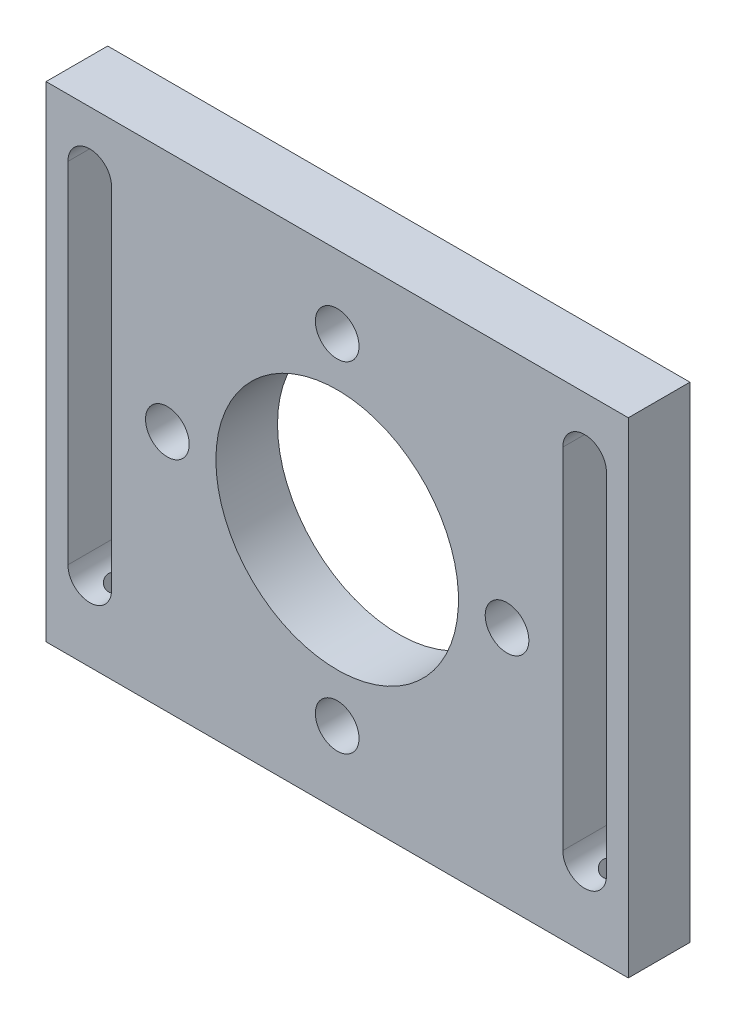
ISO-10303-21;
HEADER;
FILE_DESCRIPTION(('STEP AP214'),'2;1');
FILE_NAME('part.step','',(''),(''),'','','');
FILE_SCHEMA(('AUTOMOTIVE_DESIGN { 1 0 10303 214 1 1 1 1 }'));
ENDSEC;
DATA;
#1=APPLICATION_CONTEXT('core data for automotive mechanical design processes');
#2=APPLICATION_PROTOCOL_DEFINITION('international standard','automotive_design',2000,#1);
#3=PRODUCT_CONTEXT('',#1,'mechanical');
#4=PRODUCT('Part','Part','',(#3));
#5=PRODUCT_RELATED_PRODUCT_CATEGORY('part','',(#4));
#6=PRODUCT_DEFINITION_FORMATION('','',#4);
#7=PRODUCT_DEFINITION_CONTEXT('part definition',#1,'design');
#8=PRODUCT_DEFINITION('design','',#6,#7);
#9=PRODUCT_DEFINITION_SHAPE('','',#8);
#10=(LENGTH_UNIT() NAMED_UNIT(*) SI_UNIT(.MILLI.,.METRE.));
#11=(NAMED_UNIT(*) PLANE_ANGLE_UNIT() SI_UNIT($,.RADIAN.));
#12=(NAMED_UNIT(*) SI_UNIT($,.STERADIAN.) SOLID_ANGLE_UNIT());
#13=UNCERTAINTY_MEASURE_WITH_UNIT(LENGTH_MEASURE(1.E-05),#10,'distance_accuracy_value','');
#14=(GEOMETRIC_REPRESENTATION_CONTEXT(3) GLOBAL_UNCERTAINTY_ASSIGNED_CONTEXT((#13)) GLOBAL_UNIT_ASSIGNED_CONTEXT((#10,
#11,#12)) REPRESENTATION_CONTEXT('',''));
#15=CARTESIAN_POINT('',(0.,0.,0.));
#16=DIRECTION('',(0.,0.,1.));
#17=DIRECTION('',(1.,0.,0.));
#18=AXIS2_PLACEMENT_3D('',#15,#16,#17);
#19=CARTESIAN_POINT('',(30.,25.,6.35));
#20=DIRECTION('',(1.,0.,0.));
#21=DIRECTION('',(0.,1.,0.));
#22=AXIS2_PLACEMENT_3D('',#19,#20,#21);
#23=PLANE('',#22);
#24=DIRECTION('',(0.,-1.,0.));
#25=VECTOR('',#24,1.);
#26=CARTESIAN_POINT('',(30.,25.,0.));
#27=LINE('',#26,#25);
#28=CARTESIAN_POINT('',(30.,25.,0.));
#29=VERTEX_POINT('',#28);
#30=CARTESIAN_POINT('',(30.,-25.,0.));
#31=VERTEX_POINT('',#30);
#32=EDGE_CURVE('E187',#29,#31,#27,.T.);
#33=ORIENTED_EDGE('',*,*,#32,.F.);
#34=DIRECTION('',(0.,0.,-1.));
#35=VECTOR('',#34,1.);
#36=CARTESIAN_POINT('',(30.,25.,6.35));
#37=LINE('',#36,#35);
#38=CARTESIAN_POINT('',(30.,25.,6.35));
#39=VERTEX_POINT('',#38);
#40=EDGE_CURVE('E218',#39,#29,#37,.T.);
#41=ORIENTED_EDGE('',*,*,#40,.F.);
#42=DIRECTION('',(0.,-1.,0.));
#43=VECTOR('',#42,1.);
#44=CARTESIAN_POINT('',(30.,25.,6.35));
#45=LINE('',#44,#43);
#46=CARTESIAN_POINT('',(30.,-25.,6.35));
#47=VERTEX_POINT('',#46);
#48=EDGE_CURVE('E194',#39,#47,#45,.T.);
#49=ORIENTED_EDGE('',*,*,#48,.T.);
#50=DIRECTION('',(0.,0.,-1.));
#51=VECTOR('',#50,1.);
#52=CARTESIAN_POINT('',(30.,-25.,6.35));
#53=LINE('',#52,#51);
#54=EDGE_CURVE('E207',#47,#31,#53,.T.);
#55=ORIENTED_EDGE('',*,*,#54,.T.);
#56=EDGE_LOOP('',(#33,#41,#49,#55));
#57=FACE_BOUND('',#56,.T.);
#58=ADVANCED_FACE('F33',(#57),#23,.T.);
#59=CARTESIAN_POINT('',(-30.,25.,6.35));
#60=DIRECTION('',(0.,1.,0.));
#61=DIRECTION('',(0.,0.,1.));
#62=AXIS2_PLACEMENT_3D('',#59,#60,#61);
#63=PLANE('',#62);
#64=DIRECTION('',(1.,0.,0.));
#65=VECTOR('',#64,1.);
#66=CARTESIAN_POINT('',(-30.,25.,0.));
#67=LINE('',#66,#65);
#68=CARTESIAN_POINT('',(-30.,25.,0.));
#69=VERTEX_POINT('',#68);
#70=EDGE_CURVE('E198',#69,#29,#67,.T.);
#71=ORIENTED_EDGE('',*,*,#70,.F.);
#72=DIRECTION('',(0.,0.,-1.));
#73=VECTOR('',#72,1.);
#74=CARTESIAN_POINT('',(-30.,25.,6.35));
#75=LINE('',#74,#73);
#76=CARTESIAN_POINT('',(-30.,25.,6.35));
#77=VERTEX_POINT('',#76);
#78=EDGE_CURVE('E221',#77,#69,#75,.T.);
#79=ORIENTED_EDGE('',*,*,#78,.F.);
#80=DIRECTION('',(1.,0.,0.));
#81=VECTOR('',#80,1.);
#82=CARTESIAN_POINT('',(-30.,25.,6.35));
#83=LINE('',#82,#81);
#84=EDGE_CURVE('E204',#77,#39,#83,.T.);
#85=ORIENTED_EDGE('',*,*,#84,.T.);
#86=ORIENTED_EDGE('',*,*,#40,.T.);
#87=EDGE_LOOP('',(#71,#79,#85,#86));
#88=FACE_BOUND('',#87,.T.);
#89=ADVANCED_FACE('F262',(#88),#63,.T.);
#90=CARTESIAN_POINT('',(-30.,-25.,6.35));
#91=DIRECTION('',(-1.,0.,0.));
#92=DIRECTION('',(0.,-1.,0.));
#93=AXIS2_PLACEMENT_3D('',#90,#91,#92);
#94=PLANE('',#93);
#95=DIRECTION('',(0.,1.,0.));
#96=VECTOR('',#95,1.);
#97=CARTESIAN_POINT('',(-30.,-25.,0.));
#98=LINE('',#97,#96);
#99=CARTESIAN_POINT('',(-30.,-25.,0.));
#100=VERTEX_POINT('',#99);
#101=EDGE_CURVE('E213',#100,#69,#98,.T.);
#102=ORIENTED_EDGE('',*,*,#101,.F.);
#103=DIRECTION('',(0.,0.,-1.));
#104=VECTOR('',#103,1.);
#105=CARTESIAN_POINT('',(-30.,-25.,6.35));
#106=LINE('',#105,#104);
#107=CARTESIAN_POINT('',(-30.,-25.,6.35));
#108=VERTEX_POINT('',#107);
#109=EDGE_CURVE('E223',#108,#100,#106,.T.);
#110=ORIENTED_EDGE('',*,*,#109,.F.);
#111=DIRECTION('',(0.,1.,0.));
#112=VECTOR('',#111,1.);
#113=CARTESIAN_POINT('',(-30.,-25.,6.35));
#114=LINE('',#113,#112);
#115=EDGE_CURVE('E201',#108,#77,#114,.T.);
#116=ORIENTED_EDGE('',*,*,#115,.T.);
#117=ORIENTED_EDGE('',*,*,#78,.T.);
#118=EDGE_LOOP('',(#102,#110,#116,#117));
#119=FACE_BOUND('',#118,.T.);
#120=ADVANCED_FACE('F268',(#119),#94,.T.);
#121=CARTESIAN_POINT('',(30.,-25.,6.35));
#122=DIRECTION('',(0.,-1.,0.));
#123=DIRECTION('',(0.,0.,-1.));
#124=AXIS2_PLACEMENT_3D('',#121,#122,#123);
#125=PLANE('',#124);
#126=CARTESIAN_POINT('',(25.5,-25.,3.175));
#127=DIRECTION('',(0.,-1.,0.));
#128=DIRECTION('',(0.,0.,-1.));
#129=AXIS2_PLACEMENT_3D('',#126,#127,#128);
#130=CIRCLE('',#129,1.24999999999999);
#131=CARTESIAN_POINT('',(25.5,-25.,1.92500000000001));
#132=VERTEX_POINT('',#131);
#133=EDGE_CURVE('E334',#132,#132,#130,.T.);
#134=ORIENTED_EDGE('',*,*,#133,.F.);
#135=EDGE_LOOP('',(#134));
#136=FACE_BOUND('',#135,.T.);
#137=CARTESIAN_POINT('',(-25.5,-25.,3.175));
#138=DIRECTION('',(0.,-1.,0.));
#139=DIRECTION('',(0.,0.,-1.));
#140=AXIS2_PLACEMENT_3D('',#137,#138,#139);
#141=CIRCLE('',#140,1.24999999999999);
#142=CARTESIAN_POINT('',(-25.5,-25.,1.92500000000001));
#143=VERTEX_POINT('',#142);
#144=EDGE_CURVE('E319',#143,#143,#141,.T.);
#145=ORIENTED_EDGE('',*,*,#144,.F.);
#146=EDGE_LOOP('',(#145));
#147=FACE_BOUND('',#146,.T.);
#148=DIRECTION('',(-1.,0.,0.));
#149=VECTOR('',#148,1.);
#150=CARTESIAN_POINT('',(30.,-25.,0.));
#151=LINE('',#150,#149);
#152=EDGE_CURVE('E210',#31,#100,#151,.T.);
#153=ORIENTED_EDGE('',*,*,#152,.F.);
#154=ORIENTED_EDGE('',*,*,#54,.F.);
#155=DIRECTION('',(-1.,0.,0.));
#156=VECTOR('',#155,1.);
#157=CARTESIAN_POINT('',(30.,-25.,6.35));
#158=LINE('',#157,#156);
#159=EDGE_CURVE('E197',#47,#108,#158,.T.);
#160=ORIENTED_EDGE('',*,*,#159,.T.);
#161=ORIENTED_EDGE('',*,*,#109,.T.);
#162=EDGE_LOOP('',(#153,#154,#160,#161));
#163=FACE_BOUND('',#162,.T.);
#164=ADVANCED_FACE('F274',(#136,#147,#163),#125,.T.);
#165=CARTESIAN_POINT('',(0.,0.,6.35));
#166=DIRECTION('',(0.,0.,-1.));
#167=DIRECTION('',(-1.,0.,0.));
#168=AXIS2_PLACEMENT_3D('',#165,#166,#167);
#169=PLANE('',#168);
#170=CARTESIAN_POINT('',(0.,17.5,6.34999999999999));
#171=DIRECTION('',(0.,0.,-1.));
#172=DIRECTION('',(-1.,0.,0.));
#173=AXIS2_PLACEMENT_3D('',#170,#171,#172);
#174=CIRCLE('',#173,2.24999999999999);
#175=CARTESIAN_POINT('',(-2.24999999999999,17.5,6.34999999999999));
#176=VERTEX_POINT('',#175);
#177=EDGE_CURVE('E309',#176,#176,#174,.T.);
#178=ORIENTED_EDGE('',*,*,#177,.T.);
#179=EDGE_LOOP('',(#178));
#180=FACE_BOUND('',#179,.T.);
#181=CARTESIAN_POINT('',(-17.5000000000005,4.95236783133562E-13,6.34999999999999));
#182=DIRECTION('',(0.,0.,-1.));
#183=DIRECTION('',(-1.,0.,0.));
#184=AXIS2_PLACEMENT_3D('',#181,#182,#183);
#185=CIRCLE('',#184,2.24999999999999);
#186=CARTESIAN_POINT('',(-19.7500000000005,4.95236783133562E-13,6.34999999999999));
#187=VERTEX_POINT('',#186);
#188=EDGE_CURVE('E304',#187,#187,#185,.T.);
#189=ORIENTED_EDGE('',*,*,#188,.T.);
#190=EDGE_LOOP('',(#189));
#191=FACE_BOUND('',#190,.T.);
#192=CARTESIAN_POINT('',(-9.90473566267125E-13,-17.5,6.34999999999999));
#193=DIRECTION('',(0.,0.,-1.));
#194=DIRECTION('',(-1.,0.,0.));
#195=AXIS2_PLACEMENT_3D('',#192,#193,#194);
#196=CIRCLE('',#195,2.24999999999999);
#197=CARTESIAN_POINT('',(-2.25000000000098,-17.5,6.34999999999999));
#198=VERTEX_POINT('',#197);
#199=EDGE_CURVE('E300',#198,#198,#196,.T.);
#200=ORIENTED_EDGE('',*,*,#199,.T.);
#201=EDGE_LOOP('',(#200));
#202=FACE_BOUND('',#201,.T.);
#203=CARTESIAN_POINT('',(17.4999999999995,-4.93093651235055E-13,6.34999999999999));
#204=DIRECTION('',(0.,0.,-1.));
#205=DIRECTION('',(-1.,0.,0.));
#206=AXIS2_PLACEMENT_3D('',#203,#204,#205);
#207=CIRCLE('',#206,2.24999999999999);
#208=CARTESIAN_POINT('',(15.2499999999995,-4.93093651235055E-13,6.34999999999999));
#209=VERTEX_POINT('',#208);
#210=EDGE_CURVE('E297',#209,#209,#207,.T.);
#211=ORIENTED_EDGE('',*,*,#210,.T.);
#212=EDGE_LOOP('',(#211));
#213=FACE_BOUND('',#212,.T.);
#214=CARTESIAN_POINT('',(-1.11022302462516E-13,-1.11022302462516E-13,6.34999999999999));
#215=DIRECTION('',(0.,0.,-1.));
#216=DIRECTION('',(-1.,0.,0.));
#217=AXIS2_PLACEMENT_3D('',#214,#215,#216);
#218=CIRCLE('',#217,12.5000000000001);
#219=CARTESIAN_POINT('',(-12.5000000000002,-1.11022302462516E-13,6.34999999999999));
#220=VERTEX_POINT('',#219);
#221=EDGE_CURVE('E146',#220,#220,#218,.T.);
#222=ORIENTED_EDGE('',*,*,#221,.T.);
#223=EDGE_LOOP('',(#222));
#224=FACE_BOUND('',#223,.T.);
#225=DIRECTION('',(0.,1.,0.));
#226=VECTOR('',#225,1.);
#227=CARTESIAN_POINT('',(27.75,-17.,6.35));
#228=LINE('',#227,#226);
#229=CARTESIAN_POINT('',(27.75,-17.,6.35));
#230=VERTEX_POINT('',#229);
#231=CARTESIAN_POINT('',(27.75,19.,6.35));
#232=VERTEX_POINT('',#231);
#233=EDGE_CURVE('E152',#230,#232,#228,.T.);
#234=ORIENTED_EDGE('',*,*,#233,.F.);
#235=CARTESIAN_POINT('',(25.5,-17.,6.35));
#236=DIRECTION('',(0.,0.,1.));
#237=DIRECTION('',(1.,0.,0.));
#238=AXIS2_PLACEMENT_3D('',#235,#236,#237);
#239=CIRCLE('',#238,2.24999999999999);
#240=CARTESIAN_POINT('',(23.25,-17.,6.35));
#241=VERTEX_POINT('',#240);
#242=EDGE_CURVE('E48',#241,#230,#239,.T.);
#243=ORIENTED_EDGE('',*,*,#242,.F.);
#244=DIRECTION('',(0.,-1.,0.));
#245=VECTOR('',#244,1.);
#246=CARTESIAN_POINT('',(23.25,19.,6.35));
#247=LINE('',#246,#245);
#248=CARTESIAN_POINT('',(23.25,19.,6.35));
#249=VERTEX_POINT('',#248);
#250=EDGE_CURVE('E140',#249,#241,#247,.T.);
#251=ORIENTED_EDGE('',*,*,#250,.F.);
#252=CARTESIAN_POINT('',(25.5,19.,6.35));
#253=DIRECTION('',(0.,0.,1.));
#254=DIRECTION('',(1.,0.,0.));
#255=AXIS2_PLACEMENT_3D('',#252,#253,#254);
#256=CIRCLE('',#255,2.25);
#257=EDGE_CURVE('E143',#232,#249,#256,.T.);
#258=ORIENTED_EDGE('',*,*,#257,.F.);
#259=EDGE_LOOP('',(#234,#243,#251,#258));
#260=FACE_BOUND('',#259,.T.);
#261=DIRECTION('',(0.,1.,0.));
#262=VECTOR('',#261,1.);
#263=CARTESIAN_POINT('',(-27.75,-17.,6.35));
#264=LINE('',#263,#262);
#265=CARTESIAN_POINT('',(-27.75,-17.,6.35));
#266=VERTEX_POINT('',#265);
#267=CARTESIAN_POINT('',(-27.75,19.,6.35));
#268=VERTEX_POINT('',#267);
#269=EDGE_CURVE('E172',#266,#268,#264,.T.);
#270=ORIENTED_EDGE('',*,*,#269,.T.);
#271=CARTESIAN_POINT('',(-25.5,19.,6.35));
#272=DIRECTION('',(0.,0.,-1.));
#273=DIRECTION('',(-1.,0.,0.));
#274=AXIS2_PLACEMENT_3D('',#271,#272,#273);
#275=CIRCLE('',#274,2.25);
#276=CARTESIAN_POINT('',(-23.25,19.,6.35));
#277=VERTEX_POINT('',#276);
#278=EDGE_CURVE('E162',#268,#277,#275,.T.);
#279=ORIENTED_EDGE('',*,*,#278,.T.);
#280=DIRECTION('',(0.,-1.,0.));
#281=VECTOR('',#280,1.);
#282=CARTESIAN_POINT('',(-23.25,19.,6.35));
#283=LINE('',#282,#281);
#284=CARTESIAN_POINT('',(-23.25,-17.,6.35));
#285=VERTEX_POINT('',#284);
#286=EDGE_CURVE('E165',#277,#285,#283,.T.);
#287=ORIENTED_EDGE('',*,*,#286,.T.);
#288=CARTESIAN_POINT('',(-25.5,-17.,6.35));
#289=DIRECTION('',(0.,0.,-1.));
#290=DIRECTION('',(-1.,0.,0.));
#291=AXIS2_PLACEMENT_3D('',#288,#289,#290);
#292=CIRCLE('',#291,2.24999999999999);
#293=EDGE_CURVE('E169',#285,#266,#292,.T.);
#294=ORIENTED_EDGE('',*,*,#293,.T.);
#295=EDGE_LOOP('',(#270,#279,#287,#294));
#296=FACE_BOUND('',#295,.T.);
#297=ORIENTED_EDGE('',*,*,#48,.F.);
#298=ORIENTED_EDGE('',*,*,#84,.F.);
#299=ORIENTED_EDGE('',*,*,#115,.F.);
#300=ORIENTED_EDGE('',*,*,#159,.F.);
#301=EDGE_LOOP('',(#297,#298,#299,#300));
#302=FACE_BOUND('',#301,.T.);
#303=ADVANCED_FACE('F341',(#180,#191,#202,#213,#224,#260,#296,#302),#169,.F.);
#304=CARTESIAN_POINT('',(0.,0.,0.));
#305=DIRECTION('',(0.,0.,-1.));
#306=DIRECTION('',(-1.,0.,0.));
#307=AXIS2_PLACEMENT_3D('',#304,#305,#306);
#308=PLANE('',#307);
#309=CARTESIAN_POINT('',(17.4999999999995,-4.93093651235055E-13,0.));
#310=DIRECTION('',(0.,0.,-1.));
#311=DIRECTION('',(-1.,0.,0.));
#312=AXIS2_PLACEMENT_3D('',#309,#310,#311);
#313=CIRCLE('',#312,4.69999999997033);
#314=CARTESIAN_POINT('',(12.8000000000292,-4.93093651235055E-13,0.));
#315=VERTEX_POINT('',#314);
#316=EDGE_CURVE('E237',#315,#315,#313,.F.);
#317=ORIENTED_EDGE('',*,*,#316,.T.);
#318=EDGE_LOOP('',(#317));
#319=FACE_BOUND('',#318,.T.);
#320=CARTESIAN_POINT('',(-9.90473566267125E-13,-17.5,0.));
#321=DIRECTION('',(0.,0.,-1.));
#322=DIRECTION('',(-1.,0.,0.));
#323=AXIS2_PLACEMENT_3D('',#320,#321,#322);
#324=CIRCLE('',#323,4.69999999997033);
#325=CARTESIAN_POINT('',(-4.69999999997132,-17.5,0.));
#326=VERTEX_POINT('',#325);
#327=EDGE_CURVE('E234',#326,#326,#324,.F.);
#328=ORIENTED_EDGE('',*,*,#327,.T.);
#329=EDGE_LOOP('',(#328));
#330=FACE_BOUND('',#329,.T.);
#331=CARTESIAN_POINT('',(0.,17.5,0.));
#332=DIRECTION('',(0.,0.,-1.));
#333=DIRECTION('',(-1.,0.,0.));
#334=AXIS2_PLACEMENT_3D('',#331,#332,#333);
#335=CIRCLE('',#334,4.69999999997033);
#336=CARTESIAN_POINT('',(-4.69999999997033,17.5,0.));
#337=VERTEX_POINT('',#336);
#338=EDGE_CURVE('E231',#337,#337,#335,.F.);
#339=ORIENTED_EDGE('',*,*,#338,.T.);
#340=EDGE_LOOP('',(#339));
#341=FACE_BOUND('',#340,.T.);
#342=CARTESIAN_POINT('',(-17.5000000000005,4.95236783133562E-13,0.));
#343=DIRECTION('',(0.,0.,-1.));
#344=DIRECTION('',(-1.,0.,0.));
#345=AXIS2_PLACEMENT_3D('',#342,#343,#344);
#346=CIRCLE('',#345,4.69999999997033);
#347=CARTESIAN_POINT('',(-22.1999999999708,4.95236783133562E-13,0.));
#348=VERTEX_POINT('',#347);
#349=EDGE_CURVE('E228',#348,#348,#346,.F.);
#350=ORIENTED_EDGE('',*,*,#349,.T.);
#351=EDGE_LOOP('',(#350));
#352=FACE_BOUND('',#351,.T.);
#353=CARTESIAN_POINT('',(-1.11022302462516E-13,-1.11022302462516E-13,0.));
#354=DIRECTION('',(0.,0.,-1.));
#355=DIRECTION('',(-1.,0.,0.));
#356=AXIS2_PLACEMENT_3D('',#353,#354,#355);
#357=CIRCLE('',#356,12.5000000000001);
#358=CARTESIAN_POINT('',(-12.5000000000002,-1.11022302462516E-13,0.));
#359=VERTEX_POINT('',#358);
#360=EDGE_CURVE('E299',#359,#359,#357,.T.);
#361=ORIENTED_EDGE('',*,*,#360,.F.);
#362=EDGE_LOOP('',(#361));
#363=FACE_BOUND('',#362,.T.);
#364=CARTESIAN_POINT('',(25.5,-17.,0.));
#365=DIRECTION('',(0.,0.,1.));
#366=DIRECTION('',(1.,0.,0.));
#367=AXIS2_PLACEMENT_3D('',#364,#365,#366);
#368=CIRCLE('',#367,2.24999999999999);
#369=CARTESIAN_POINT('',(23.25,-17.,0.));
#370=VERTEX_POINT('',#369);
#371=CARTESIAN_POINT('',(27.75,-17.,0.));
#372=VERTEX_POINT('',#371);
#373=EDGE_CURVE('E124',#370,#372,#368,.T.);
#374=ORIENTED_EDGE('',*,*,#373,.T.);
#375=DIRECTION('',(0.,1.,0.));
#376=VECTOR('',#375,1.);
#377=CARTESIAN_POINT('',(27.75,-17.,0.));
#378=LINE('',#377,#376);
#379=CARTESIAN_POINT('',(27.75,19.,0.));
#380=VERTEX_POINT('',#379);
#381=EDGE_CURVE('E133',#372,#380,#378,.T.);
#382=ORIENTED_EDGE('',*,*,#381,.T.);
#383=CARTESIAN_POINT('',(25.5,19.,0.));
#384=DIRECTION('',(0.,0.,1.));
#385=DIRECTION('',(1.,0.,0.));
#386=AXIS2_PLACEMENT_3D('',#383,#384,#385);
#387=CIRCLE('',#386,2.25);
#388=CARTESIAN_POINT('',(23.25,19.,0.));
#389=VERTEX_POINT('',#388);
#390=EDGE_CURVE('E56',#380,#389,#387,.T.);
#391=ORIENTED_EDGE('',*,*,#390,.T.);
#392=DIRECTION('',(0.,-1.,0.));
#393=VECTOR('',#392,1.);
#394=CARTESIAN_POINT('',(23.25,19.,0.));
#395=LINE('',#394,#393);
#396=EDGE_CURVE('E130',#389,#370,#395,.T.);
#397=ORIENTED_EDGE('',*,*,#396,.T.);
#398=EDGE_LOOP('',(#374,#382,#391,#397));
#399=FACE_BOUND('',#398,.T.);
#400=CARTESIAN_POINT('',(-25.5,19.,0.));
#401=DIRECTION('',(0.,0.,-1.));
#402=DIRECTION('',(-1.,0.,0.));
#403=AXIS2_PLACEMENT_3D('',#400,#401,#402);
#404=CIRCLE('',#403,2.25);
#405=CARTESIAN_POINT('',(-27.75,19.,0.));
#406=VERTEX_POINT('',#405);
#407=CARTESIAN_POINT('',(-23.25,19.,0.));
#408=VERTEX_POINT('',#407);
#409=EDGE_CURVE('E158',#406,#408,#404,.T.);
#410=ORIENTED_EDGE('',*,*,#409,.F.);
#411=DIRECTION('',(0.,1.,0.));
#412=VECTOR('',#411,1.);
#413=CARTESIAN_POINT('',(-27.75,-17.,0.));
#414=LINE('',#413,#412);
#415=CARTESIAN_POINT('',(-27.75,-17.,0.));
#416=VERTEX_POINT('',#415);
#417=EDGE_CURVE('E166',#416,#406,#414,.T.);
#418=ORIENTED_EDGE('',*,*,#417,.F.);
#419=CARTESIAN_POINT('',(-25.5,-17.,0.));
#420=DIRECTION('',(0.,0.,-1.));
#421=DIRECTION('',(-1.,0.,0.));
#422=AXIS2_PLACEMENT_3D('',#419,#420,#421);
#423=CIRCLE('',#422,2.24999999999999);
#424=CARTESIAN_POINT('',(-23.25,-17.,0.));
#425=VERTEX_POINT('',#424);
#426=EDGE_CURVE('E180',#425,#416,#423,.T.);
#427=ORIENTED_EDGE('',*,*,#426,.F.);
#428=DIRECTION('',(0.,-1.,0.));
#429=VECTOR('',#428,1.);
#430=CARTESIAN_POINT('',(-23.25,19.,0.));
#431=LINE('',#430,#429);
#432=EDGE_CURVE('E177',#408,#425,#431,.T.);
#433=ORIENTED_EDGE('',*,*,#432,.F.);
#434=EDGE_LOOP('',(#410,#418,#427,#433));
#435=FACE_BOUND('',#434,.T.);
#436=ORIENTED_EDGE('',*,*,#32,.T.);
#437=ORIENTED_EDGE('',*,*,#152,.T.);
#438=ORIENTED_EDGE('',*,*,#101,.T.);
#439=ORIENTED_EDGE('',*,*,#70,.T.);
#440=EDGE_LOOP('',(#436,#437,#438,#439));
#441=FACE_BOUND('',#440,.T.);
#442=ADVANCED_FACE('F137',(#319,#330,#341,#352,#363,#399,#435,#441),#308,.T.);
#443=CARTESIAN_POINT('',(-25.5,19.,6.35));
#444=DIRECTION('',(0.,0.,-1.));
#445=DIRECTION('',(-1.,0.,0.));
#446=AXIS2_PLACEMENT_3D('',#443,#444,#445);
#447=CYLINDRICAL_SURFACE('',#446,2.25);
#448=ORIENTED_EDGE('',*,*,#409,.T.);
#449=DIRECTION('',(0.,0.,-1.));
#450=VECTOR('',#449,1.);
#451=CARTESIAN_POINT('',(-23.25,19.,6.35));
#452=LINE('',#451,#450);
#453=EDGE_CURVE('E175',#277,#408,#452,.T.);
#454=ORIENTED_EDGE('',*,*,#453,.F.);
#455=ORIENTED_EDGE('',*,*,#278,.F.);
#456=DIRECTION('',(0.,0.,-1.));
#457=VECTOR('',#456,1.);
#458=CARTESIAN_POINT('',(-27.75,19.,6.35));
#459=LINE('',#458,#457);
#460=EDGE_CURVE('E185',#268,#406,#459,.T.);
#461=ORIENTED_EDGE('',*,*,#460,.T.);
#462=EDGE_LOOP('',(#448,#454,#455,#461));
#463=FACE_BOUND('',#462,.T.);
#464=ADVANCED_FACE('F361',(#463),#447,.F.);
#465=CARTESIAN_POINT('',(-27.75,-17.,6.35));
#466=DIRECTION('',(-1.,0.,0.));
#467=DIRECTION('',(0.,0.,1.));
#468=AXIS2_PLACEMENT_3D('',#465,#466,#467);
#469=PLANE('',#468);
#470=ORIENTED_EDGE('',*,*,#417,.T.);
#471=ORIENTED_EDGE('',*,*,#460,.F.);
#472=ORIENTED_EDGE('',*,*,#269,.F.);
#473=DIRECTION('',(0.,0.,-1.));
#474=VECTOR('',#473,1.);
#475=CARTESIAN_POINT('',(-27.75,-17.,6.35));
#476=LINE('',#475,#474);
#477=EDGE_CURVE('E188',#266,#416,#476,.T.);
#478=ORIENTED_EDGE('',*,*,#477,.T.);
#479=EDGE_LOOP('',(#470,#471,#472,#478));
#480=FACE_BOUND('',#479,.T.);
#481=ADVANCED_FACE('F368',(#480),#469,.F.);
#482=CARTESIAN_POINT('',(-25.5,-17.,6.35));
#483=DIRECTION('',(0.,0.,-1.));
#484=DIRECTION('',(-1.,0.,0.));
#485=AXIS2_PLACEMENT_3D('',#482,#483,#484);
#486=CYLINDRICAL_SURFACE('',#485,2.24999999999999);
#487=CARTESIAN_POINT('',(-25.5,-19.25,1.92500000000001));
#488=CARTESIAN_POINT('',(-25.4351209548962,-19.2500015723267,1.92499816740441));
#489=CARTESIAN_POINT('',(-25.3702524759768,-19.2471698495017,1.93007328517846));
#490=CARTESIAN_POINT('',(-25.2425319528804,-19.2361396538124,1.95009593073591));
#491=CARTESIAN_POINT('',(-25.1796802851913,-19.227940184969,1.96504529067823));
#492=CARTESIAN_POINT('',(-25.0579563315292,-19.2070121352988,2.00403007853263));
#493=CARTESIAN_POINT('',(-24.9990703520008,-19.1943002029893,2.02803212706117));
#494=CARTESIAN_POINT('',(-24.8862701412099,-19.1654628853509,2.08421583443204));
#495=CARTESIAN_POINT('',(-24.8323571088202,-19.1493366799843,2.11639945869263));
#496=CARTESIAN_POINT('',(-24.726831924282,-19.1137699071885,2.19054334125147));
#497=CARTESIAN_POINT('',(-24.6756404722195,-19.094176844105,2.23302782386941));
#498=CARTESIAN_POINT('',(-24.5807059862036,-19.0542773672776,2.32541633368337));
#499=CARTESIAN_POINT('',(-24.5369705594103,-19.0339702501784,2.37532784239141));
#500=CARTESIAN_POINT('',(-24.4537146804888,-18.9925262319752,2.48715760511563));
#501=CARTESIAN_POINT('',(-24.4150705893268,-18.9715138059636,2.54978005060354));
#502=CARTESIAN_POINT('',(-24.3490315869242,-18.9337084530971,2.68184569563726));
#503=CARTESIAN_POINT('',(-24.3216205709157,-18.9169094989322,2.75127895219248));
#504=CARTESIAN_POINT('',(-24.2838589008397,-18.8931165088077,2.88002861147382));
#505=CARTESIAN_POINT('',(-24.2711336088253,-18.8848038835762,2.93840483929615));
#506=CARTESIAN_POINT('',(-24.254160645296,-18.8736308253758,3.05686781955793));
#507=CARTESIAN_POINT('',(-24.2499046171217,-18.8707650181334,3.11695282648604));
#508=CARTESIAN_POINT('',(-24.2500987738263,-18.8708946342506,3.23716554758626));
#509=CARTESIAN_POINT('',(-24.2545584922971,-18.8738964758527,3.29729323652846));
#510=CARTESIAN_POINT('',(-24.2719477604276,-18.8853359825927,3.41578896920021));
#511=CARTESIAN_POINT('',(-24.2848828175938,-18.8937771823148,3.47415584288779));
#512=CARTESIAN_POINT('',(-24.3186117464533,-18.9149971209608,3.58771612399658));
#513=CARTESIAN_POINT('',(-24.3394073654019,-18.9277768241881,3.64290882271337));
#514=CARTESIAN_POINT('',(-24.3881487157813,-18.9562930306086,3.74920376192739));
#515=CARTESIAN_POINT('',(-24.4160972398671,-18.9720306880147,3.80030439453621));
#516=CARTESIAN_POINT('',(-24.4832678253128,-19.0075874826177,3.9052066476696));
#517=CARTESIAN_POINT('',(-24.5235576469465,-19.0276634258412,3.95823862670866));
#518=CARTESIAN_POINT('',(-24.6120158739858,-19.0679334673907,4.0572684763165));
#519=CARTESIAN_POINT('',(-24.6601904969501,-19.0881276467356,4.10326073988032));
#520=CARTESIAN_POINT('',(-24.7689304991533,-19.1287870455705,4.19157447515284));
#521=CARTESIAN_POINT('',(-24.8302569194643,-19.149072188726,4.23305109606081));
#522=CARTESIAN_POINT('',(-24.960260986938,-19.1853427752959,4.30490527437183));
#523=CARTESIAN_POINT('',(-25.0289337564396,-19.2013310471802,4.3352901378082));
#524=CARTESIAN_POINT('',(-25.1666259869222,-19.2261854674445,4.38175541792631));
#525=CARTESIAN_POINT('',(-25.2352755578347,-19.2354762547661,4.39869738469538));
#526=CARTESIAN_POINT('',(-25.3749879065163,-19.2476148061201,4.42073685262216));
#527=CARTESIAN_POINT('',(-25.4460484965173,-19.2504682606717,4.42584481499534));
#528=CARTESIAN_POINT('',(-25.5798684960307,-19.2494639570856,4.4240333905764));
#529=CARTESIAN_POINT('',(-25.6426558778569,-19.2463302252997,4.41841162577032));
#530=CARTESIAN_POINT('',(-25.766230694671,-19.2350548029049,4.39792407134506));
#531=CARTESIAN_POINT('',(-25.8270180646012,-19.2269129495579,4.38305798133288));
#532=CARTESIAN_POINT('',(-25.9448130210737,-19.206401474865,4.34481434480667));
#533=CARTESIAN_POINT('',(-26.0018336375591,-19.1940474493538,4.32146817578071));
#534=CARTESIAN_POINT('',(-26.111212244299,-19.1661278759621,4.26708690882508));
#535=CARTESIAN_POINT('',(-26.1635689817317,-19.1505614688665,4.23604975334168));
#536=CARTESIAN_POINT('',(-26.2679354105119,-19.1156809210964,4.1635439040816));
#537=CARTESIAN_POINT('',(-26.3193527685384,-19.0961458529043,4.12132962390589));
#538=CARTESIAN_POINT('',(-26.4147695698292,-19.0563015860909,4.02945346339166));
#539=CARTESIAN_POINT('',(-26.4587607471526,-19.0359915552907,3.97978339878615));
#540=CARTESIAN_POINT('',(-26.5425598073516,-18.9944843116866,3.86846917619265));
#541=CARTESIAN_POINT('',(-26.5815000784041,-18.9734037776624,3.80612286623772));
#542=CARTESIAN_POINT('',(-26.648189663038,-18.9353663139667,3.67457767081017));
#543=CARTESIAN_POINT('',(-26.6759548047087,-18.9184035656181,3.60538865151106));
#544=CARTESIAN_POINT('',(-26.7144444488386,-18.8942095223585,3.47689151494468));
#545=CARTESIAN_POINT('',(-26.7275144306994,-18.8856868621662,3.41852936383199));
#546=CARTESIAN_POINT('',(-26.7451696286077,-18.8740782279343,3.30002668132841));
#547=CARTESIAN_POINT('',(-26.7497633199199,-18.8709868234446,3.23988798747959));
#548=CARTESIAN_POINT('',(-26.7502190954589,-18.8706823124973,3.11948912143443));
#549=CARTESIAN_POINT('',(-26.7460703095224,-18.873476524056,3.05922889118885));
#550=CARTESIAN_POINT('',(-26.7292582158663,-18.8845480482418,2.94041600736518));
#551=CARTESIAN_POINT('',(-26.7165894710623,-18.8928288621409,2.88186446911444));
#552=CARTESIAN_POINT('',(-26.6833974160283,-18.9137526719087,2.76809056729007));
#553=CARTESIAN_POINT('',(-26.6628978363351,-18.9263824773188,2.71285872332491));
#554=CARTESIAN_POINT('',(-26.6147472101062,-18.9546396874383,2.60644585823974));
#555=CARTESIAN_POINT('',(-26.5870934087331,-18.9702682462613,2.55526640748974));
#556=CARTESIAN_POINT('',(-26.5205963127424,-19.005617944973,2.45021885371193));
#557=CARTESIAN_POINT('',(-26.4806948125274,-19.0256009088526,2.39710779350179));
#558=CARTESIAN_POINT('',(-26.3930296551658,-19.0657505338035,2.29785244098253));
#559=CARTESIAN_POINT('',(-26.3452596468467,-19.0859173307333,2.25171383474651));
#560=CARTESIAN_POINT('',(-26.2372393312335,-19.1266506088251,2.16289367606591));
#561=CARTESIAN_POINT('',(-26.176207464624,-19.1470401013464,2.121072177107));
#562=CARTESIAN_POINT('',(-26.0467457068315,-19.1835932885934,2.04847246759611));
#563=CARTESIAN_POINT('',(-25.978321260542,-19.1997600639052,2.01768620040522));
#564=CARTESIAN_POINT('',(-25.8424116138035,-19.2247670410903,1.97086428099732));
#565=CARTESIAN_POINT('',(-25.7753983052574,-19.2341365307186,1.95374867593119));
#566=CARTESIAN_POINT('',(-25.6389179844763,-19.2467497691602,1.93082194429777));
#567=CARTESIAN_POINT('',(-25.5694529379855,-19.2499983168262,1.92500196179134));
#568=CARTESIAN_POINT('',(-25.5,-19.25,1.92500000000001));
#569=B_SPLINE_CURVE_WITH_KNOTS('',3,(#487,#488,#489,#490,#491,#492,#493,#494,#495,#496,#497,
#498,#499,#500,#501,#502,#503,#504,#505,#506,#507,#508,#509,#510,#511,#512,#513,#514,#515,#516,
#517,#518,#519,#520,#521,#522,#523,#524,#525,#526,#527,#528,#529,#530,#531,#532,#533,#534,#535,
#536,#537,#538,#539,#540,#541,#542,#543,#544,#545,#546,#547,#548,#549,#550,#551,#552,#553,#554,
#555,#556,#557,#558,#559,#560,#561,#562,#563,#564,#565,#566,#567,#568),.UNSPECIFIED.,.T.,.F.,(4,
2,2,2,2,2,2,2,2,2,2,2,2,2,2,2,2,2,2,2,2,2,2,2,2,2,2,2,2,2,2,2,2,2,2,2,2,2,2,2,4),(0.,
0.194367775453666,0.388771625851,0.582465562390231,0.776206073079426,0.983418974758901,
1.19084204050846,1.41928633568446,1.64740195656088,1.82758088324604,2.00758193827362,
2.18777999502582,2.36809526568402,2.54845064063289,2.72887653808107,2.93672102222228,
3.14473019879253,3.37382737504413,3.60277337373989,3.81548472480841,4.02800796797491,
4.21644267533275,4.40488350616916,4.59263406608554,4.78043490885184,4.98759837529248,
5.19499093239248,5.42327208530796,5.65122876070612,5.83167651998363,6.01194375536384,
6.19243526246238,6.37304206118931,6.55310583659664,6.73323905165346,6.94051710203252,
7.14796328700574,7.37700746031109,7.60588407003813,7.81411785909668,8.02218832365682),.UNSPECIFIED.);
#570=CARTESIAN_POINT('',(-25.5,-19.25,1.92500000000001));
#571=VERTEX_POINT('',#570);
#572=EDGE_CURVE('E312',#571,#571,#569,.T.);
#573=ORIENTED_EDGE('',*,*,#572,.T.);
#574=EDGE_LOOP('',(#573));
#575=FACE_BOUND('',#574,.T.);
#576=ORIENTED_EDGE('',*,*,#426,.T.);
#577=ORIENTED_EDGE('',*,*,#477,.F.);
#578=ORIENTED_EDGE('',*,*,#293,.F.);
#579=DIRECTION('',(0.,0.,-1.));
#580=VECTOR('',#579,1.);
#581=CARTESIAN_POINT('',(-23.25,-17.,6.35));
#582=LINE('',#581,#580);
#583=EDGE_CURVE('E190',#285,#425,#582,.T.);
#584=ORIENTED_EDGE('',*,*,#583,.T.);
#585=EDGE_LOOP('',(#576,#577,#578,#584));
#586=FACE_BOUND('',#585,.T.);
#587=ADVANCED_FACE('F373',(#575,#586),#486,.F.);
#588=CARTESIAN_POINT('',(-23.25,19.,6.35));
#589=DIRECTION('',(1.,0.,0.));
#590=DIRECTION('',(0.,1.,0.));
#591=AXIS2_PLACEMENT_3D('',#588,#589,#590);
#592=PLANE('',#591);
#593=ORIENTED_EDGE('',*,*,#432,.T.);
#594=ORIENTED_EDGE('',*,*,#583,.F.);
#595=ORIENTED_EDGE('',*,*,#286,.F.);
#596=ORIENTED_EDGE('',*,*,#453,.T.);
#597=EDGE_LOOP('',(#593,#594,#595,#596));
#598=FACE_BOUND('',#597,.T.);
#599=ADVANCED_FACE('F370',(#598),#592,.F.);
#600=CARTESIAN_POINT('',(25.5,-17.,0.));
#601=DIRECTION('',(0.,0.,1.));
#602=DIRECTION('',(1.,0.,0.));
#603=AXIS2_PLACEMENT_3D('',#600,#601,#602);
#604=CYLINDRICAL_SURFACE('',#603,2.24999999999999);
#605=CARTESIAN_POINT('',(25.5,-19.25,1.92500000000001));
#606=CARTESIAN_POINT('',(25.5648790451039,-19.2500015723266,1.92499816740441));
#607=CARTESIAN_POINT('',(25.6297475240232,-19.2471698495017,1.93007328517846));
#608=CARTESIAN_POINT('',(25.7574680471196,-19.2361396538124,1.95009593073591));
#609=CARTESIAN_POINT('',(25.8203197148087,-19.227940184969,1.96504529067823));
#610=CARTESIAN_POINT('',(25.9420436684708,-19.2070121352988,2.00403007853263));
#611=CARTESIAN_POINT('',(26.0009296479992,-19.1943002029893,2.02803212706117));
#612=CARTESIAN_POINT('',(26.1137298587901,-19.1654628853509,2.08421583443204));
#613=CARTESIAN_POINT('',(26.1676428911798,-19.1493366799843,2.11639945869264));
#614=CARTESIAN_POINT('',(26.273168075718,-19.1137699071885,2.19054334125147));
#615=CARTESIAN_POINT('',(26.3243595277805,-19.094176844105,2.23302782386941));
#616=CARTESIAN_POINT('',(26.4192940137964,-19.0542773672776,2.32541633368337));
#617=CARTESIAN_POINT('',(26.4630294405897,-19.0339702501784,2.37532784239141));
#618=CARTESIAN_POINT('',(26.5462853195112,-18.9925262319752,2.48715760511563));
#619=CARTESIAN_POINT('',(26.5849294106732,-18.9715138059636,2.54978005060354));
#620=CARTESIAN_POINT('',(26.6509684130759,-18.9337084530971,2.68184569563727));
#621=CARTESIAN_POINT('',(26.6783794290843,-18.9169094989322,2.75127895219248));
#622=CARTESIAN_POINT('',(26.7161410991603,-18.8931165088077,2.88002861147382));
#623=CARTESIAN_POINT('',(26.7288663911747,-18.8848038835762,2.93840483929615));
#624=CARTESIAN_POINT('',(26.745839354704,-18.8736308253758,3.05686781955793));
#625=CARTESIAN_POINT('',(26.7500953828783,-18.8707650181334,3.11695282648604));
#626=CARTESIAN_POINT('',(26.7499012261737,-18.8708946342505,3.23716554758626));
#627=CARTESIAN_POINT('',(26.7454415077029,-18.8738964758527,3.29729323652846));
#628=CARTESIAN_POINT('',(26.7280522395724,-18.8853359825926,3.41578896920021));
#629=CARTESIAN_POINT('',(26.7151171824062,-18.8937771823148,3.47415584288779));
#630=CARTESIAN_POINT('',(26.6813882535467,-18.9149971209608,3.58771612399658));
#631=CARTESIAN_POINT('',(26.6605926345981,-18.9277768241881,3.64290882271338));
#632=CARTESIAN_POINT('',(26.6118512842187,-18.9562930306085,3.74920376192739));
#633=CARTESIAN_POINT('',(26.5839027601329,-18.9720306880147,3.80030439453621));
#634=CARTESIAN_POINT('',(26.5167321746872,-19.0075874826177,3.9052066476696));
#635=CARTESIAN_POINT('',(26.4764423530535,-19.0276634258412,3.95823862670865));
#636=CARTESIAN_POINT('',(26.3879841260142,-19.0679334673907,4.0572684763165));
#637=CARTESIAN_POINT('',(26.3398095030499,-19.0881276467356,4.10326073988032));
#638=CARTESIAN_POINT('',(26.2310695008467,-19.1287870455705,4.19157447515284));
#639=CARTESIAN_POINT('',(26.1697430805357,-19.149072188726,4.23305109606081));
#640=CARTESIAN_POINT('',(26.039739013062,-19.1853427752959,4.30490527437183));
#641=CARTESIAN_POINT('',(25.9710662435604,-19.2013310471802,4.3352901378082));
#642=CARTESIAN_POINT('',(25.8333740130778,-19.2261854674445,4.38175541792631));
#643=CARTESIAN_POINT('',(25.7647244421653,-19.2354762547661,4.39869738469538));
#644=CARTESIAN_POINT('',(25.6250120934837,-19.2476148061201,4.42073685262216));
#645=CARTESIAN_POINT('',(25.5539515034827,-19.2504682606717,4.42584481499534));
#646=CARTESIAN_POINT('',(25.4201315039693,-19.2494639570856,4.4240333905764));
#647=CARTESIAN_POINT('',(25.3573441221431,-19.2463302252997,4.41841162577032));
#648=CARTESIAN_POINT('',(25.233769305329,-19.2350548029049,4.39792407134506));
#649=CARTESIAN_POINT('',(25.1729819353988,-19.2269129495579,4.38305798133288));
#650=CARTESIAN_POINT('',(25.0551869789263,-19.206401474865,4.34481434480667));
#651=CARTESIAN_POINT('',(24.9981663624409,-19.1940474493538,4.32146817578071));
#652=CARTESIAN_POINT('',(24.888787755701,-19.1661278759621,4.26708690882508));
#653=CARTESIAN_POINT('',(24.8364310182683,-19.1505614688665,4.23604975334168));
#654=CARTESIAN_POINT('',(24.7320645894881,-19.1156809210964,4.1635439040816));
#655=CARTESIAN_POINT('',(24.6806472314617,-19.0961458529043,4.12132962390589));
#656=CARTESIAN_POINT('',(24.5852304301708,-19.0563015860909,4.02945346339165));
#657=CARTESIAN_POINT('',(24.5412392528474,-19.0359915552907,3.97978339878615));
#658=CARTESIAN_POINT('',(24.4574401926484,-18.9944843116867,3.86846917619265));
#659=CARTESIAN_POINT('',(24.418499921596,-18.9734037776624,3.80612286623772));
#660=CARTESIAN_POINT('',(24.351810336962,-18.9353663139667,3.67457767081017));
#661=CARTESIAN_POINT('',(24.3240451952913,-18.9184035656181,3.60538865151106));
#662=CARTESIAN_POINT('',(24.2855555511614,-18.8942095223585,3.47689151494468));
#663=CARTESIAN_POINT('',(24.2724855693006,-18.8856868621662,3.41852936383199));
#664=CARTESIAN_POINT('',(24.2548303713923,-18.8740782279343,3.30002668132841));
#665=CARTESIAN_POINT('',(24.2502366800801,-18.8709868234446,3.23988798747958));
#666=CARTESIAN_POINT('',(24.2497809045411,-18.8706823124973,3.11948912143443));
#667=CARTESIAN_POINT('',(24.2539296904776,-18.873476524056,3.05922889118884));
#668=CARTESIAN_POINT('',(24.2707417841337,-18.8845480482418,2.94041600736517));
#669=CARTESIAN_POINT('',(24.2834105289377,-18.8928288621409,2.88186446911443));
#670=CARTESIAN_POINT('',(24.3166025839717,-18.9137526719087,2.76809056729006));
#671=CARTESIAN_POINT('',(24.3371021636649,-18.9263824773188,2.7128587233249));
#672=CARTESIAN_POINT('',(24.3852527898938,-18.9546396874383,2.60644585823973));
#673=CARTESIAN_POINT('',(24.4129065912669,-18.9702682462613,2.55526640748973));
#674=CARTESIAN_POINT('',(24.4794036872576,-19.005617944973,2.45021885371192));
#675=CARTESIAN_POINT('',(24.5193051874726,-19.0256009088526,2.39710779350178));
#676=CARTESIAN_POINT('',(24.6069703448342,-19.0657505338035,2.29785244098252));
#677=CARTESIAN_POINT('',(24.6547403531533,-19.0859173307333,2.2517138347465));
#678=CARTESIAN_POINT('',(24.7627606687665,-19.1266506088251,2.16289367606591));
#679=CARTESIAN_POINT('',(24.823792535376,-19.1470401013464,2.121072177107));
#680=CARTESIAN_POINT('',(24.9532542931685,-19.1835932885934,2.04847246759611));
#681=CARTESIAN_POINT('',(25.021678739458,-19.1997600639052,2.01768620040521));
#682=CARTESIAN_POINT('',(25.1575883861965,-19.2247670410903,1.97086428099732));
#683=CARTESIAN_POINT('',(25.2246016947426,-19.2341365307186,1.95374867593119));
#684=CARTESIAN_POINT('',(25.3610820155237,-19.2467497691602,1.93082194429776));
#685=CARTESIAN_POINT('',(25.4305470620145,-19.2499983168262,1.92500196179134));
#686=CARTESIAN_POINT('',(25.5,-19.25,1.92500000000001));
#687=B_SPLINE_CURVE_WITH_KNOTS('',3,(#605,#606,#607,#608,#609,#610,#611,#612,#613,#614,#615,
#616,#617,#618,#619,#620,#621,#622,#623,#624,#625,#626,#627,#628,#629,#630,#631,#632,#633,#634,
#635,#636,#637,#638,#639,#640,#641,#642,#643,#644,#645,#646,#647,#648,#649,#650,#651,#652,#653,
#654,#655,#656,#657,#658,#659,#660,#661,#662,#663,#664,#665,#666,#667,#668,#669,#670,#671,#672,
#673,#674,#675,#676,#677,#678,#679,#680,#681,#682,#683,#684,#685,#686),.UNSPECIFIED.,.T.,.F.,(4,
2,2,2,2,2,2,2,2,2,2,2,2,2,2,2,2,2,2,2,2,2,2,2,2,2,2,2,2,2,2,2,2,2,2,2,2,2,2,2,4),(0.,
0.194367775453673,0.388771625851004,0.582465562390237,0.776206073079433,0.983418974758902,
1.19084204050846,1.41928633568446,1.64740195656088,1.82758088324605,2.00758193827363,
2.18777999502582,2.36809526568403,2.54845064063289,2.72887653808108,2.93672102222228,
3.14473019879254,3.37382737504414,3.60277337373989,3.81548472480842,4.02800796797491,
4.21644267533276,4.40488350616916,4.59263406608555,4.78043490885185,4.98759837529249,
5.19499093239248,5.42327208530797,5.65122876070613,5.83167651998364,6.01194375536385,
6.19243526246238,6.37304206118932,6.55310583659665,6.73323905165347,6.94051710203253,
7.14796328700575,7.3770074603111,7.60588407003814,7.81411785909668,8.02218832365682),.UNSPECIFIED.);
#688=CARTESIAN_POINT('',(25.5,-19.25,1.92500000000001));
#689=VERTEX_POINT('',#688);
#690=EDGE_CURVE('E329',#689,#689,#687,.T.);
#691=ORIENTED_EDGE('',*,*,#690,.T.);
#692=EDGE_LOOP('',(#691));
#693=FACE_BOUND('',#692,.T.);
#694=ORIENTED_EDGE('',*,*,#242,.T.);
#695=DIRECTION('',(0.,0.,1.));
#696=VECTOR('',#695,1.);
#697=CARTESIAN_POINT('',(27.75,-17.,0.));
#698=LINE('',#697,#696);
#699=EDGE_CURVE('E120',#372,#230,#698,.T.);
#700=ORIENTED_EDGE('',*,*,#699,.F.);
#701=ORIENTED_EDGE('',*,*,#373,.F.);
#702=DIRECTION('',(0.,0.,1.));
#703=VECTOR('',#702,1.);
#704=CARTESIAN_POINT('',(23.25,-17.,0.));
#705=LINE('',#704,#703);
#706=EDGE_CURVE('E156',#370,#241,#705,.T.);
#707=ORIENTED_EDGE('',*,*,#706,.T.);
#708=EDGE_LOOP('',(#694,#700,#701,#707));
#709=FACE_BOUND('',#708,.T.);
#710=ADVANCED_FACE('F122',(#693,#709),#604,.F.);
#711=CARTESIAN_POINT('',(23.25,19.,0.));
#712=DIRECTION('',(-1.,0.,0.));
#713=DIRECTION('',(0.,-1.,0.));
#714=AXIS2_PLACEMENT_3D('',#711,#712,#713);
#715=PLANE('',#714);
#716=ORIENTED_EDGE('',*,*,#250,.T.);
#717=ORIENTED_EDGE('',*,*,#706,.F.);
#718=ORIENTED_EDGE('',*,*,#396,.F.);
#719=DIRECTION('',(0.,0.,1.));
#720=VECTOR('',#719,1.);
#721=CARTESIAN_POINT('',(23.25,19.,0.));
#722=LINE('',#721,#720);
#723=EDGE_CURVE('E159',#389,#249,#722,.T.);
#724=ORIENTED_EDGE('',*,*,#723,.T.);
#725=EDGE_LOOP('',(#716,#717,#718,#724));
#726=FACE_BOUND('',#725,.T.);
#727=ADVANCED_FACE('F383',(#726),#715,.F.);
#728=CARTESIAN_POINT('',(25.5,19.,0.));
#729=DIRECTION('',(0.,0.,1.));
#730=DIRECTION('',(1.,0.,0.));
#731=AXIS2_PLACEMENT_3D('',#728,#729,#730);
#732=CYLINDRICAL_SURFACE('',#731,2.25);
#733=ORIENTED_EDGE('',*,*,#257,.T.);
#734=ORIENTED_EDGE('',*,*,#723,.F.);
#735=ORIENTED_EDGE('',*,*,#390,.F.);
#736=DIRECTION('',(0.,0.,1.));
#737=VECTOR('',#736,1.);
#738=CARTESIAN_POINT('',(27.75,19.,0.));
#739=LINE('',#738,#737);
#740=EDGE_CURVE('E129',#380,#232,#739,.T.);
#741=ORIENTED_EDGE('',*,*,#740,.T.);
#742=EDGE_LOOP('',(#733,#734,#735,#741));
#743=FACE_BOUND('',#742,.T.);
#744=ADVANCED_FACE('F387',(#743),#732,.F.);
#745=CARTESIAN_POINT('',(27.75,-17.,0.));
#746=DIRECTION('',(1.,0.,0.));
#747=DIRECTION('',(0.,1.,0.));
#748=AXIS2_PLACEMENT_3D('',#745,#746,#747);
#749=PLANE('',#748);
#750=ORIENTED_EDGE('',*,*,#233,.T.);
#751=ORIENTED_EDGE('',*,*,#740,.F.);
#752=ORIENTED_EDGE('',*,*,#381,.F.);
#753=ORIENTED_EDGE('',*,*,#699,.T.);
#754=EDGE_LOOP('',(#750,#751,#752,#753));
#755=FACE_BOUND('',#754,.T.);
#756=ADVANCED_FACE('F134',(#755),#749,.F.);
#757=CARTESIAN_POINT('',(-1.11022302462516E-13,-1.11022302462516E-13,0.));
#758=DIRECTION('',(0.,0.,-1.));
#759=DIRECTION('',(-1.,0.,0.));
#760=AXIS2_PLACEMENT_3D('',#757,#758,#759);
#761=CYLINDRICAL_SURFACE('',#760,12.5000000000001);
#762=ORIENTED_EDGE('',*,*,#221,.F.);
#763=EDGE_LOOP('',(#762));
#764=FACE_BOUND('',#763,.T.);
#765=ORIENTED_EDGE('',*,*,#360,.T.);
#766=EDGE_LOOP('',(#765));
#767=FACE_BOUND('',#766,.T.);
#768=ADVANCED_FACE('F293',(#764,#767),#761,.F.);
#769=CARTESIAN_POINT('',(17.4999999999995,-4.93093651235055E-13,0.));
#770=DIRECTION('',(0.,0.,-1.));
#771=DIRECTION('',(-1.,0.,0.));
#772=AXIS2_PLACEMENT_3D('',#769,#770,#771);
#773=CYLINDRICAL_SURFACE('',#772,2.24999999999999);
#774=CARTESIAN_POINT('',(17.4999999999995,-4.93093651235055E-13,2.44999999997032));
#775=DIRECTION('',(0.,0.,-1.));
#776=DIRECTION('',(-1.,0.,0.));
#777=AXIS2_PLACEMENT_3D('',#774,#775,#776);
#778=CIRCLE('',#777,2.24999999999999);
#779=CARTESIAN_POINT('',(15.2499999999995,-4.93093651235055E-13,2.44999999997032));
#780=VERTEX_POINT('',#779);
#781=EDGE_CURVE('E220',#780,#780,#778,.T.);
#782=ORIENTED_EDGE('',*,*,#781,.T.);
#783=EDGE_LOOP('',(#782));
#784=FACE_BOUND('',#783,.T.);
#785=ORIENTED_EDGE('',*,*,#210,.F.);
#786=EDGE_LOOP('',(#785));
#787=FACE_BOUND('',#786,.T.);
#788=ADVANCED_FACE('F289',(#784,#787),#773,.F.);
#789=CARTESIAN_POINT('',(-9.90473566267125E-13,-17.5,0.));
#790=DIRECTION('',(0.,0.,-1.));
#791=DIRECTION('',(-1.,0.,0.));
#792=AXIS2_PLACEMENT_3D('',#789,#790,#791);
#793=CYLINDRICAL_SURFACE('',#792,2.24999999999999);
#794=CARTESIAN_POINT('',(-9.90473566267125E-13,-17.5,2.44999999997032));
#795=DIRECTION('',(0.,0.,-1.));
#796=DIRECTION('',(-1.,0.,0.));
#797=AXIS2_PLACEMENT_3D('',#794,#795,#796);
#798=CIRCLE('',#797,2.24999999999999);
#799=CARTESIAN_POINT('',(-2.25000000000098,-17.5,2.44999999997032));
#800=VERTEX_POINT('',#799);
#801=EDGE_CURVE('E240',#800,#800,#798,.T.);
#802=ORIENTED_EDGE('',*,*,#801,.T.);
#803=EDGE_LOOP('',(#802));
#804=FACE_BOUND('',#803,.T.);
#805=ORIENTED_EDGE('',*,*,#199,.F.);
#806=EDGE_LOOP('',(#805));
#807=FACE_BOUND('',#806,.T.);
#808=ADVANCED_FACE('F292',(#804,#807),#793,.F.);
#809=CARTESIAN_POINT('',(-17.5000000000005,4.95236783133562E-13,0.));
#810=DIRECTION('',(0.,0.,-1.));
#811=DIRECTION('',(-1.,0.,0.));
#812=AXIS2_PLACEMENT_3D('',#809,#810,#811);
#813=CYLINDRICAL_SURFACE('',#812,2.24999999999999);
#814=CARTESIAN_POINT('',(-17.5000000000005,4.95236783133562E-13,2.44999999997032));
#815=DIRECTION('',(0.,0.,-1.));
#816=DIRECTION('',(-1.,0.,0.));
#817=AXIS2_PLACEMENT_3D('',#814,#815,#816);
#818=CIRCLE('',#817,2.24999999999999);
#819=CARTESIAN_POINT('',(-19.7500000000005,4.95236783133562E-13,2.44999999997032));
#820=VERTEX_POINT('',#819);
#821=EDGE_CURVE('E11',#820,#820,#818,.T.);
#822=ORIENTED_EDGE('',*,*,#821,.T.);
#823=EDGE_LOOP('',(#822));
#824=FACE_BOUND('',#823,.T.);
#825=ORIENTED_EDGE('',*,*,#188,.F.);
#826=EDGE_LOOP('',(#825));
#827=FACE_BOUND('',#826,.T.);
#828=ADVANCED_FACE('F398',(#824,#827),#813,.F.);
#829=CARTESIAN_POINT('',(0.,17.5,0.));
#830=DIRECTION('',(0.,0.,-1.));
#831=DIRECTION('',(-1.,0.,0.));
#832=AXIS2_PLACEMENT_3D('',#829,#830,#831);
#833=CYLINDRICAL_SURFACE('',#832,2.24999999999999);
#834=CARTESIAN_POINT('',(0.,17.5,2.44999999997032));
#835=DIRECTION('',(0.,0.,-1.));
#836=DIRECTION('',(-1.,0.,0.));
#837=AXIS2_PLACEMENT_3D('',#834,#835,#836);
#838=CIRCLE('',#837,2.24999999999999);
#839=CARTESIAN_POINT('',(-2.24999999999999,17.5,2.44999999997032));
#840=VERTEX_POINT('',#839);
#841=EDGE_CURVE('E41',#840,#840,#838,.T.);
#842=ORIENTED_EDGE('',*,*,#841,.T.);
#843=EDGE_LOOP('',(#842));
#844=FACE_BOUND('',#843,.T.);
#845=ORIENTED_EDGE('',*,*,#177,.F.);
#846=EDGE_LOOP('',(#845));
#847=FACE_BOUND('',#846,.T.);
#848=ADVANCED_FACE('F245',(#844,#847),#833,.F.);
#849=CARTESIAN_POINT('',(-25.5,-25.,3.175));
#850=DIRECTION('',(0.,-1.,0.));
#851=DIRECTION('',(0.,0.,-1.));
#852=AXIS2_PLACEMENT_3D('',#849,#850,#851);
#853=CYLINDRICAL_SURFACE('',#852,1.24999999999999);
#854=ORIENTED_EDGE('',*,*,#572,.F.);
#855=EDGE_LOOP('',(#854));
#856=FACE_BOUND('',#855,.T.);
#857=ORIENTED_EDGE('',*,*,#144,.T.);
#858=EDGE_LOOP('',(#857));
#859=FACE_BOUND('',#858,.T.);
#860=ADVANCED_FACE('F282',(#856,#859),#853,.F.);
#861=CARTESIAN_POINT('',(25.5,-25.,3.175));
#862=DIRECTION('',(0.,-1.,0.));
#863=DIRECTION('',(0.,0.,-1.));
#864=AXIS2_PLACEMENT_3D('',#861,#862,#863);
#865=CYLINDRICAL_SURFACE('',#864,1.24999999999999);
#866=ORIENTED_EDGE('',*,*,#690,.F.);
#867=EDGE_LOOP('',(#866));
#868=FACE_BOUND('',#867,.T.);
#869=ORIENTED_EDGE('',*,*,#133,.T.);
#870=EDGE_LOOP('',(#869));
#871=FACE_BOUND('',#870,.T.);
#872=ADVANCED_FACE('F277',(#868,#871),#865,.F.);
#873=CARTESIAN_POINT('',(17.4999999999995,-4.93093651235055E-13,2.44999999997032));
#874=DIRECTION('',(0.,0.,-1.));
#875=DIRECTION('',(-1.,0.,0.));
#876=AXIS2_PLACEMENT_3D('',#873,#874,#875);
#877=CONICAL_SURFACE('',#876,2.24999999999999,0.785398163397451);
#878=ORIENTED_EDGE('',*,*,#316,.F.);
#879=EDGE_LOOP('',(#878));
#880=FACE_BOUND('',#879,.T.);
#881=ORIENTED_EDGE('',*,*,#781,.F.);
#882=EDGE_LOOP('',(#881));
#883=FACE_BOUND('',#882,.T.);
#884=ADVANCED_FACE('F257',(#880,#883),#877,.F.);
#885=CARTESIAN_POINT('',(-9.90473566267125E-13,-17.5,2.44999999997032));
#886=DIRECTION('',(0.,0.,-1.));
#887=DIRECTION('',(-1.,0.,0.));
#888=AXIS2_PLACEMENT_3D('',#885,#886,#887);
#889=CONICAL_SURFACE('',#888,2.24999999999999,0.785398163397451);
#890=ORIENTED_EDGE('',*,*,#327,.F.);
#891=EDGE_LOOP('',(#890));
#892=FACE_BOUND('',#891,.T.);
#893=ORIENTED_EDGE('',*,*,#801,.F.);
#894=EDGE_LOOP('',(#893));
#895=FACE_BOUND('',#894,.T.);
#896=ADVANCED_FACE('F250',(#892,#895),#889,.F.);
#897=CARTESIAN_POINT('',(0.,17.5,2.44999999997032));
#898=DIRECTION('',(0.,0.,-1.));
#899=DIRECTION('',(-1.,0.,0.));
#900=AXIS2_PLACEMENT_3D('',#897,#898,#899);
#901=CONICAL_SURFACE('',#900,2.24999999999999,0.785398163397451);
#902=ORIENTED_EDGE('',*,*,#338,.F.);
#903=EDGE_LOOP('',(#902));
#904=FACE_BOUND('',#903,.T.);
#905=ORIENTED_EDGE('',*,*,#841,.F.);
#906=EDGE_LOOP('',(#905));
#907=FACE_BOUND('',#906,.T.);
#908=ADVANCED_FACE('F248',(#904,#907),#901,.F.);
#909=CARTESIAN_POINT('',(-17.5000000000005,4.95236783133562E-13,2.44999999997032));
#910=DIRECTION('',(0.,0.,-1.));
#911=DIRECTION('',(-1.,0.,0.));
#912=AXIS2_PLACEMENT_3D('',#909,#910,#911);
#913=CONICAL_SURFACE('',#912,2.24999999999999,0.785398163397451);
#914=ORIENTED_EDGE('',*,*,#349,.F.);
#915=EDGE_LOOP('',(#914));
#916=FACE_BOUND('',#915,.T.);
#917=ORIENTED_EDGE('',*,*,#821,.F.);
#918=EDGE_LOOP('',(#917));
#919=FACE_BOUND('',#918,.T.);
#920=ADVANCED_FACE('F35',(#916,#919),#913,.F.);
#921=CLOSED_SHELL('',(#58,#89,#120,#164,#303,#442,#464,#481,#587,#599,#710,#727,#744,#756,#768,
#788,#808,#828,#848,#860,#872,#884,#896,#908,#920));
#922=MANIFOLD_SOLID_BREP('B2',#921);
#923=ADVANCED_BREP_SHAPE_REPRESENTATION('',(#18,#922),#14);
#924=SHAPE_DEFINITION_REPRESENTATION(#9,#923);
ENDSEC;
END-ISO-10303-21;
